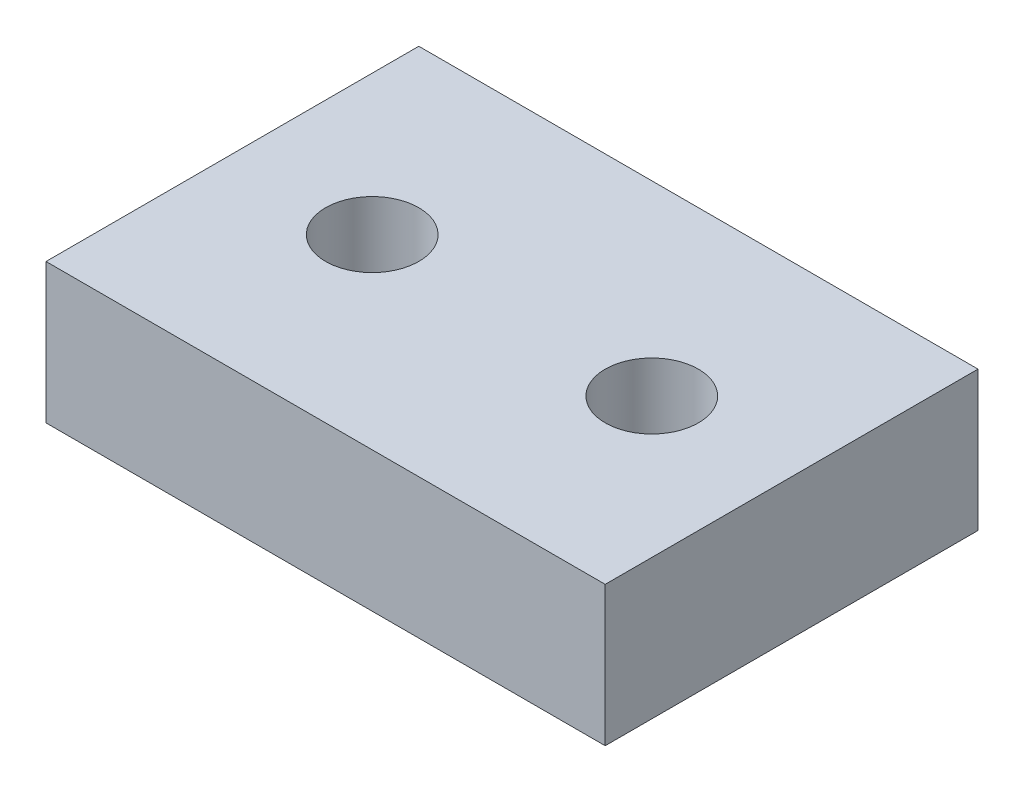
ISO-10303-21;
HEADER;
FILE_DESCRIPTION(('STEP AP214'),'2;1');
FILE_NAME('part.step','',(''),(''),'','','');
FILE_SCHEMA(('AUTOMOTIVE_DESIGN { 1 0 10303 214 1 1 1 1 }'));
ENDSEC;
DATA;
#1=APPLICATION_CONTEXT('core data for automotive mechanical design processes');
#2=APPLICATION_PROTOCOL_DEFINITION('international standard','automotive_design',2000,#1);
#3=PRODUCT_CONTEXT('',#1,'mechanical');
#4=PRODUCT('Part','Part','',(#3));
#5=PRODUCT_RELATED_PRODUCT_CATEGORY('part','',(#4));
#6=PRODUCT_DEFINITION_FORMATION('','',#4);
#7=PRODUCT_DEFINITION_CONTEXT('part definition',#1,'design');
#8=PRODUCT_DEFINITION('design','',#6,#7);
#9=PRODUCT_DEFINITION_SHAPE('','',#8);
#10=(LENGTH_UNIT() NAMED_UNIT(*) SI_UNIT(.MILLI.,.METRE.));
#11=(NAMED_UNIT(*) PLANE_ANGLE_UNIT() SI_UNIT($,.RADIAN.));
#12=(NAMED_UNIT(*) SI_UNIT($,.STERADIAN.) SOLID_ANGLE_UNIT());
#13=UNCERTAINTY_MEASURE_WITH_UNIT(LENGTH_MEASURE(1.E-05),#10,'distance_accuracy_value','');
#14=(GEOMETRIC_REPRESENTATION_CONTEXT(3) GLOBAL_UNCERTAINTY_ASSIGNED_CONTEXT((#13)) GLOBAL_UNIT_ASSIGNED_CONTEXT((#10,
#11,#12)) REPRESENTATION_CONTEXT('',''));
#15=CARTESIAN_POINT('',(0.,0.,0.));
#16=DIRECTION('',(0.,0.,1.));
#17=DIRECTION('',(1.,0.,0.));
#18=AXIS2_PLACEMENT_3D('',#15,#16,#17);
#19=CARTESIAN_POINT('',(0.,0.,50.8));
#20=DIRECTION('',(-1.,0.,0.));
#21=DIRECTION('',(0.,0.,1.));
#22=AXIS2_PLACEMENT_3D('',#19,#20,#21);
#23=PLANE('',#22);
#24=DIRECTION('',(0.,1.,0.));
#25=VECTOR('',#24,1.);
#26=CARTESIAN_POINT('',(0.,0.,0.));
#27=LINE('',#26,#25);
#28=CARTESIAN_POINT('',(0.,0.,0.));
#29=VERTEX_POINT('',#28);
#30=CARTESIAN_POINT('',(0.,19.05,0.));
#31=VERTEX_POINT('',#30);
#32=EDGE_CURVE('E111',#29,#31,#27,.T.);
#33=ORIENTED_EDGE('',*,*,#32,.F.);
#34=DIRECTION('',(0.,0.,-1.));
#35=VECTOR('',#34,1.);
#36=CARTESIAN_POINT('',(0.,0.,50.8));
#37=LINE('',#36,#35);
#38=CARTESIAN_POINT('',(0.,0.,50.8));
#39=VERTEX_POINT('',#38);
#40=EDGE_CURVE('E11',#39,#29,#37,.T.);
#41=ORIENTED_EDGE('',*,*,#40,.F.);
#42=DIRECTION('',(0.,1.,0.));
#43=VECTOR('',#42,1.);
#44=CARTESIAN_POINT('',(0.,0.,50.8));
#45=LINE('',#44,#43);
#46=CARTESIAN_POINT('',(0.,19.05,50.8));
#47=VERTEX_POINT('',#46);
#48=EDGE_CURVE('E100',#39,#47,#45,.T.);
#49=ORIENTED_EDGE('',*,*,#48,.T.);
#50=DIRECTION('',(0.,0.,-1.));
#51=VECTOR('',#50,1.);
#52=CARTESIAN_POINT('',(0.,19.05,50.8));
#53=LINE('',#52,#51);
#54=EDGE_CURVE('E44',#47,#31,#53,.T.);
#55=ORIENTED_EDGE('',*,*,#54,.T.);
#56=EDGE_LOOP('',(#33,#41,#49,#55));
#57=FACE_BOUND('',#56,.T.);
#58=ADVANCED_FACE('F41',(#57),#23,.T.);
#59=CARTESIAN_POINT('',(0.,0.,50.8));
#60=DIRECTION('',(0.,1.,0.));
#61=DIRECTION('',(-1.,0.,0.));
#62=AXIS2_PLACEMENT_3D('',#59,#60,#61);
#63=PLANE('',#62);
#64=CARTESIAN_POINT('',(19.05,0.,25.4));
#65=DIRECTION('',(0.,1.,0.));
#66=DIRECTION('',(-1.,0.,0.));
#67=AXIS2_PLACEMENT_3D('',#64,#65,#66);
#68=CIRCLE('',#67,6.35);
#69=CARTESIAN_POINT('',(12.7,0.,25.4));
#70=VERTEX_POINT('',#69);
#71=EDGE_CURVE('E141',#70,#70,#68,.T.);
#72=ORIENTED_EDGE('',*,*,#71,.T.);
#73=EDGE_LOOP('',(#72));
#74=FACE_BOUND('',#73,.T.);
#75=CARTESIAN_POINT('',(57.15,0.,25.4));
#76=DIRECTION('',(0.,1.,0.));
#77=DIRECTION('',(-1.,0.,0.));
#78=AXIS2_PLACEMENT_3D('',#75,#76,#77);
#79=CIRCLE('',#78,6.35);
#80=CARTESIAN_POINT('',(50.8,0.,25.4));
#81=VERTEX_POINT('',#80);
#82=EDGE_CURVE('E116',#81,#81,#79,.T.);
#83=ORIENTED_EDGE('',*,*,#82,.T.);
#84=EDGE_LOOP('',(#83));
#85=FACE_BOUND('',#84,.T.);
#86=DIRECTION('',(1.,0.,0.));
#87=VECTOR('',#86,1.);
#88=CARTESIAN_POINT('',(0.,0.,0.));
#89=LINE('',#88,#87);
#90=CARTESIAN_POINT('',(76.2,0.,0.));
#91=VERTEX_POINT('',#90);
#92=EDGE_CURVE('E121',#29,#91,#89,.T.);
#93=ORIENTED_EDGE('',*,*,#92,.T.);
#94=DIRECTION('',(0.,0.,-1.));
#95=VECTOR('',#94,1.);
#96=CARTESIAN_POINT('',(76.2,0.,50.8));
#97=LINE('',#96,#95);
#98=CARTESIAN_POINT('',(76.2,0.,50.8));
#99=VERTEX_POINT('',#98);
#100=EDGE_CURVE('E51',#99,#91,#97,.T.);
#101=ORIENTED_EDGE('',*,*,#100,.F.);
#102=DIRECTION('',(1.,0.,0.));
#103=VECTOR('',#102,1.);
#104=CARTESIAN_POINT('',(0.,0.,50.8));
#105=LINE('',#104,#103);
#106=EDGE_CURVE('E103',#39,#99,#105,.T.);
#107=ORIENTED_EDGE('',*,*,#106,.F.);
#108=ORIENTED_EDGE('',*,*,#40,.T.);
#109=EDGE_LOOP('',(#93,#101,#107,#108));
#110=FACE_BOUND('',#109,.T.);
#111=ADVANCED_FACE('F133',(#74,#85,#110),#63,.F.);
#112=CARTESIAN_POINT('',(76.2,19.05,50.8));
#113=DIRECTION('',(1.,0.,0.));
#114=DIRECTION('',(0.,0.,-1.));
#115=AXIS2_PLACEMENT_3D('',#112,#113,#114);
#116=PLANE('',#115);
#117=DIRECTION('',(0.,-1.,0.));
#118=VECTOR('',#117,1.);
#119=CARTESIAN_POINT('',(76.2,19.05,0.));
#120=LINE('',#119,#118);
#121=CARTESIAN_POINT('',(76.2,19.05,0.));
#122=VERTEX_POINT('',#121);
#123=EDGE_CURVE('E93',#122,#91,#120,.T.);
#124=ORIENTED_EDGE('',*,*,#123,.F.);
#125=DIRECTION('',(0.,0.,-1.));
#126=VECTOR('',#125,1.);
#127=CARTESIAN_POINT('',(76.2,19.05,50.8));
#128=LINE('',#127,#126);
#129=CARTESIAN_POINT('',(76.2,19.05,50.8));
#130=VERTEX_POINT('',#129);
#131=EDGE_CURVE('E89',#130,#122,#128,.T.);
#132=ORIENTED_EDGE('',*,*,#131,.F.);
#133=DIRECTION('',(0.,-1.,0.));
#134=VECTOR('',#133,1.);
#135=CARTESIAN_POINT('',(76.2,19.05,50.8));
#136=LINE('',#135,#134);
#137=EDGE_CURVE('E91',#130,#99,#136,.T.);
#138=ORIENTED_EDGE('',*,*,#137,.T.);
#139=ORIENTED_EDGE('',*,*,#100,.T.);
#140=EDGE_LOOP('',(#124,#132,#138,#139));
#141=FACE_BOUND('',#140,.T.);
#142=ADVANCED_FACE('F90',(#141),#116,.T.);
#143=CARTESIAN_POINT('',(76.2,19.05,50.8));
#144=DIRECTION('',(0.,-1.,0.));
#145=DIRECTION('',(1.,0.,0.));
#146=AXIS2_PLACEMENT_3D('',#143,#144,#145);
#147=PLANE('',#146);
#148=CARTESIAN_POINT('',(19.05,19.05,25.4));
#149=DIRECTION('',(0.,1.,0.));
#150=DIRECTION('',(-1.,0.,0.));
#151=AXIS2_PLACEMENT_3D('',#148,#149,#150);
#152=CIRCLE('',#151,6.35);
#153=CARTESIAN_POINT('',(12.7,19.05,25.4));
#154=VERTEX_POINT('',#153);
#155=EDGE_CURVE('E145',#154,#154,#152,.T.);
#156=ORIENTED_EDGE('',*,*,#155,.F.);
#157=EDGE_LOOP('',(#156));
#158=FACE_BOUND('',#157,.T.);
#159=CARTESIAN_POINT('',(57.15,19.05,25.4));
#160=DIRECTION('',(0.,1.,0.));
#161=DIRECTION('',(-1.,0.,0.));
#162=AXIS2_PLACEMENT_3D('',#159,#160,#161);
#163=CIRCLE('',#162,6.35);
#164=CARTESIAN_POINT('',(50.8,19.05,25.4));
#165=VERTEX_POINT('',#164);
#166=EDGE_CURVE('E137',#165,#165,#163,.T.);
#167=ORIENTED_EDGE('',*,*,#166,.F.);
#168=EDGE_LOOP('',(#167));
#169=FACE_BOUND('',#168,.T.);
#170=DIRECTION('',(-1.,0.,0.));
#171=VECTOR('',#170,1.);
#172=CARTESIAN_POINT('',(76.2,19.05,0.));
#173=LINE('',#172,#171);
#174=EDGE_CURVE('E115',#122,#31,#173,.T.);
#175=ORIENTED_EDGE('',*,*,#174,.T.);
#176=ORIENTED_EDGE('',*,*,#54,.F.);
#177=DIRECTION('',(-1.,0.,0.));
#178=VECTOR('',#177,1.);
#179=CARTESIAN_POINT('',(76.2,19.05,50.8));
#180=LINE('',#179,#178);
#181=EDGE_CURVE('E86',#130,#47,#180,.T.);
#182=ORIENTED_EDGE('',*,*,#181,.F.);
#183=ORIENTED_EDGE('',*,*,#131,.T.);
#184=EDGE_LOOP('',(#175,#176,#182,#183));
#185=FACE_BOUND('',#184,.T.);
#186=ADVANCED_FACE('F98',(#158,#169,#185),#147,.F.);
#187=CARTESIAN_POINT('',(0.,0.,50.8));
#188=DIRECTION('',(0.,0.,-1.));
#189=DIRECTION('',(-1.,0.,0.));
#190=AXIS2_PLACEMENT_3D('',#187,#188,#189);
#191=PLANE('',#190);
#192=ORIENTED_EDGE('',*,*,#48,.F.);
#193=ORIENTED_EDGE('',*,*,#106,.T.);
#194=ORIENTED_EDGE('',*,*,#137,.F.);
#195=ORIENTED_EDGE('',*,*,#181,.T.);
#196=EDGE_LOOP('',(#192,#193,#194,#195));
#197=FACE_BOUND('',#196,.T.);
#198=ADVANCED_FACE('F102',(#197),#191,.F.);
#199=CARTESIAN_POINT('',(0.,0.,0.));
#200=DIRECTION('',(0.,0.,-1.));
#201=DIRECTION('',(-1.,0.,0.));
#202=AXIS2_PLACEMENT_3D('',#199,#200,#201);
#203=PLANE('',#202);
#204=ORIENTED_EDGE('',*,*,#32,.T.);
#205=ORIENTED_EDGE('',*,*,#174,.F.);
#206=ORIENTED_EDGE('',*,*,#123,.T.);
#207=ORIENTED_EDGE('',*,*,#92,.F.);
#208=EDGE_LOOP('',(#204,#205,#206,#207));
#209=FACE_BOUND('',#208,.T.);
#210=ADVANCED_FACE('F132',(#209),#203,.T.);
#211=CARTESIAN_POINT('',(57.15,0.,25.4));
#212=DIRECTION('',(0.,1.,0.));
#213=DIRECTION('',(-1.,0.,0.));
#214=AXIS2_PLACEMENT_3D('',#211,#212,#213);
#215=CYLINDRICAL_SURFACE('',#214,6.35);
#216=ORIENTED_EDGE('',*,*,#82,.F.);
#217=EDGE_LOOP('',(#216));
#218=FACE_BOUND('',#217,.T.);
#219=ORIENTED_EDGE('',*,*,#166,.T.);
#220=EDGE_LOOP('',(#219));
#221=FACE_BOUND('',#220,.T.);
#222=ADVANCED_FACE('F159',(#218,#221),#215,.F.);
#223=CARTESIAN_POINT('',(19.05,0.,25.4));
#224=DIRECTION('',(0.,1.,0.));
#225=DIRECTION('',(-1.,0.,0.));
#226=AXIS2_PLACEMENT_3D('',#223,#224,#225);
#227=CYLINDRICAL_SURFACE('',#226,6.35);
#228=ORIENTED_EDGE('',*,*,#71,.F.);
#229=EDGE_LOOP('',(#228));
#230=FACE_BOUND('',#229,.T.);
#231=ORIENTED_EDGE('',*,*,#155,.T.);
#232=EDGE_LOOP('',(#231));
#233=FACE_BOUND('',#232,.T.);
#234=ADVANCED_FACE('F156',(#230,#233),#227,.F.);
#235=CLOSED_SHELL('',(#58,#111,#142,#186,#198,#210,#222,#234));
#236=MANIFOLD_SOLID_BREP('B2',#235);
#237=ADVANCED_BREP_SHAPE_REPRESENTATION('',(#18,#236),#14);
#238=SHAPE_DEFINITION_REPRESENTATION(#9,#237);
ENDSEC;
END-ISO-10303-21;
